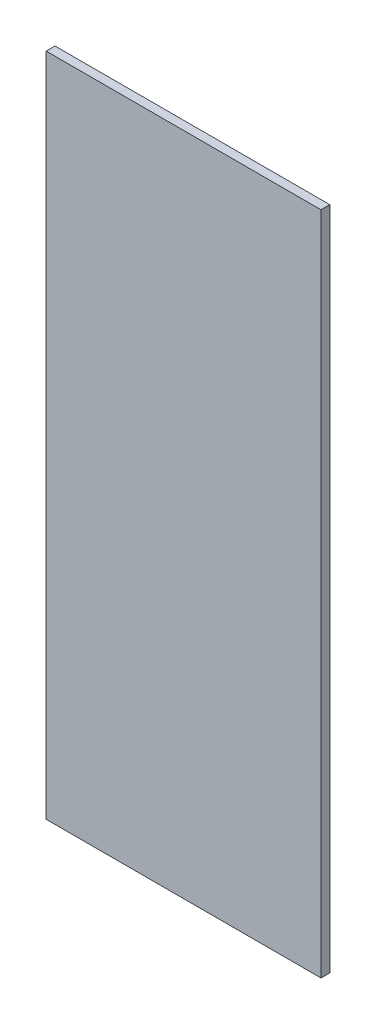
ISO-10303-21;
HEADER;
FILE_DESCRIPTION(('STEP AP214'),'2;1');
FILE_NAME('part.step','',(''),(''),'','','');
FILE_SCHEMA(('AUTOMOTIVE_DESIGN { 1 0 10303 214 1 1 1 1 }'));
ENDSEC;
DATA;
#1=APPLICATION_CONTEXT('core data for automotive mechanical design processes');
#2=APPLICATION_PROTOCOL_DEFINITION('international standard','automotive_design',2000,#1);
#3=PRODUCT_CONTEXT('',#1,'mechanical');
#4=PRODUCT('Part','Part','',(#3));
#5=PRODUCT_RELATED_PRODUCT_CATEGORY('part','',(#4));
#6=PRODUCT_DEFINITION_FORMATION('','',#4);
#7=PRODUCT_DEFINITION_CONTEXT('part definition',#1,'design');
#8=PRODUCT_DEFINITION('design','',#6,#7);
#9=PRODUCT_DEFINITION_SHAPE('','',#8);
#10=(LENGTH_UNIT() NAMED_UNIT(*) SI_UNIT(.MILLI.,.METRE.));
#11=(NAMED_UNIT(*) PLANE_ANGLE_UNIT() SI_UNIT($,.RADIAN.));
#12=(NAMED_UNIT(*) SI_UNIT($,.STERADIAN.) SOLID_ANGLE_UNIT());
#13=UNCERTAINTY_MEASURE_WITH_UNIT(LENGTH_MEASURE(1.E-05),#10,'distance_accuracy_value','');
#14=(GEOMETRIC_REPRESENTATION_CONTEXT(3) GLOBAL_UNCERTAINTY_ASSIGNED_CONTEXT((#13)) GLOBAL_UNIT_ASSIGNED_CONTEXT((#10,
#11,#12)) REPRESENTATION_CONTEXT('',''));
#15=CARTESIAN_POINT('',(0.,0.,0.));
#16=DIRECTION('',(0.,0.,1.));
#17=DIRECTION('',(1.,0.,0.));
#18=AXIS2_PLACEMENT_3D('',#15,#16,#17);
#19=CARTESIAN_POINT('',(6.575,19.35,-0.03048));
#20=DIRECTION('',(0.,-1.,0.));
#21=DIRECTION('',(0.,0.,-1.));
#22=AXIS2_PLACEMENT_3D('',#19,#20,#21);
#23=PLANE('',#22);
#24=DIRECTION('',(1.,0.,0.));
#25=VECTOR('',#24,1.);
#26=CARTESIAN_POINT('',(7.05,19.35,0.));
#27=LINE('',#26,#25);
#28=CARTESIAN_POINT('',(6.575,19.35,0.));
#29=VERTEX_POINT('',#28);
#30=CARTESIAN_POINT('',(7.525,19.35,0.));
#31=VERTEX_POINT('',#30);
#32=EDGE_CURVE('E74',#29,#31,#27,.T.);
#33=ORIENTED_EDGE('',*,*,#32,.T.);
#34=DIRECTION('',(0.,0.,-1.));
#35=VECTOR('',#34,1.);
#36=CARTESIAN_POINT('',(7.525,19.35,-0.01524));
#37=LINE('',#36,#35);
#38=CARTESIAN_POINT('',(7.525,19.35,-0.03048));
#39=VERTEX_POINT('',#38);
#40=EDGE_CURVE('E111',#31,#39,#37,.T.);
#41=ORIENTED_EDGE('',*,*,#40,.T.);
#42=DIRECTION('',(1.,0.,0.));
#43=VECTOR('',#42,1.);
#44=CARTESIAN_POINT('',(6.575,19.35,-0.03048));
#45=LINE('',#44,#43);
#46=CARTESIAN_POINT('',(6.575,19.35,-0.03048));
#47=VERTEX_POINT('',#46);
#48=EDGE_CURVE('E76',#47,#39,#45,.T.);
#49=ORIENTED_EDGE('',*,*,#48,.F.);
#50=DIRECTION('',(0.,0.,-1.));
#51=VECTOR('',#50,1.);
#52=CARTESIAN_POINT('',(6.575,19.35,-0.01524));
#53=LINE('',#52,#51);
#54=EDGE_CURVE('E11',#29,#47,#53,.T.);
#55=ORIENTED_EDGE('',*,*,#54,.F.);
#56=EDGE_LOOP('',(#33,#41,#49,#55));
#57=FACE_BOUND('',#56,.T.);
#58=ADVANCED_FACE('F17',(#57),#23,.F.);
#59=CARTESIAN_POINT('',(6.575,17.05,-0.03048));
#60=DIRECTION('',(1.,0.,0.));
#61=DIRECTION('',(0.,1.,0.));
#62=AXIS2_PLACEMENT_3D('',#59,#60,#61);
#63=PLANE('',#62);
#64=DIRECTION('',(0.,1.,0.));
#65=VECTOR('',#64,1.);
#66=CARTESIAN_POINT('',(6.575,18.2,0.));
#67=LINE('',#66,#65);
#68=CARTESIAN_POINT('',(6.575,17.05,0.));
#69=VERTEX_POINT('',#68);
#70=EDGE_CURVE('E80',#69,#29,#67,.T.);
#71=ORIENTED_EDGE('',*,*,#70,.T.);
#72=ORIENTED_EDGE('',*,*,#54,.T.);
#73=DIRECTION('',(0.,1.,0.));
#74=VECTOR('',#73,1.);
#75=CARTESIAN_POINT('',(6.575,17.05,-0.03048));
#76=LINE('',#75,#74);
#77=CARTESIAN_POINT('',(6.575,17.05,-0.03048));
#78=VERTEX_POINT('',#77);
#79=EDGE_CURVE('E108',#78,#47,#76,.T.);
#80=ORIENTED_EDGE('',*,*,#79,.F.);
#81=DIRECTION('',(0.,0.,-1.));
#82=VECTOR('',#81,1.);
#83=CARTESIAN_POINT('',(6.575,17.05,-0.01524));
#84=LINE('',#83,#82);
#85=EDGE_CURVE('E20',#69,#78,#84,.T.);
#86=ORIENTED_EDGE('',*,*,#85,.F.);
#87=EDGE_LOOP('',(#71,#72,#80,#86));
#88=FACE_BOUND('',#87,.T.);
#89=ADVANCED_FACE('F81',(#88),#63,.F.);
#90=CARTESIAN_POINT('',(7.525,17.05,-0.03048));
#91=DIRECTION('',(0.,1.,0.));
#92=DIRECTION('',(1.,0.,0.));
#93=AXIS2_PLACEMENT_3D('',#90,#91,#92);
#94=PLANE('',#93);
#95=DIRECTION('',(-1.,0.,0.));
#96=VECTOR('',#95,1.);
#97=CARTESIAN_POINT('',(7.05,17.05,0.));
#98=LINE('',#97,#96);
#99=CARTESIAN_POINT('',(7.525,17.05,0.));
#100=VERTEX_POINT('',#99);
#101=EDGE_CURVE('E85',#100,#69,#98,.T.);
#102=ORIENTED_EDGE('',*,*,#101,.T.);
#103=ORIENTED_EDGE('',*,*,#85,.T.);
#104=DIRECTION('',(-1.,0.,0.));
#105=VECTOR('',#104,1.);
#106=CARTESIAN_POINT('',(7.525,17.05,-0.03048));
#107=LINE('',#106,#105);
#108=CARTESIAN_POINT('',(7.525,17.05,-0.03048));
#109=VERTEX_POINT('',#108);
#110=EDGE_CURVE('E104',#109,#78,#107,.T.);
#111=ORIENTED_EDGE('',*,*,#110,.F.);
#112=DIRECTION('',(0.,0.,-1.));
#113=VECTOR('',#112,1.);
#114=CARTESIAN_POINT('',(7.525,17.05,-0.01524));
#115=LINE('',#114,#113);
#116=EDGE_CURVE('E47',#100,#109,#115,.T.);
#117=ORIENTED_EDGE('',*,*,#116,.F.);
#118=EDGE_LOOP('',(#102,#103,#111,#117));
#119=FACE_BOUND('',#118,.T.);
#120=ADVANCED_FACE('F139',(#119),#94,.F.);
#121=CARTESIAN_POINT('',(7.525,19.35,-0.03048));
#122=DIRECTION('',(-1.,0.,0.));
#123=DIRECTION('',(0.,0.,1.));
#124=AXIS2_PLACEMENT_3D('',#121,#122,#123);
#125=PLANE('',#124);
#126=DIRECTION('',(0.,-1.,0.));
#127=VECTOR('',#126,1.);
#128=CARTESIAN_POINT('',(7.525,18.2,0.));
#129=LINE('',#128,#127);
#130=EDGE_CURVE('E89',#31,#100,#129,.T.);
#131=ORIENTED_EDGE('',*,*,#130,.T.);
#132=ORIENTED_EDGE('',*,*,#116,.T.);
#133=DIRECTION('',(0.,-1.,0.));
#134=VECTOR('',#133,1.);
#135=CARTESIAN_POINT('',(7.525,19.35,-0.03048));
#136=LINE('',#135,#134);
#137=EDGE_CURVE('E100',#39,#109,#136,.T.);
#138=ORIENTED_EDGE('',*,*,#137,.F.);
#139=ORIENTED_EDGE('',*,*,#40,.F.);
#140=EDGE_LOOP('',(#131,#132,#138,#139));
#141=FACE_BOUND('',#140,.T.);
#142=ADVANCED_FACE('F133',(#141),#125,.F.);
#143=CARTESIAN_POINT('',(7.05,18.2,-0.03048));
#144=DIRECTION('',(0.,0.,1.));
#145=DIRECTION('',(1.,0.,0.));
#146=AXIS2_PLACEMENT_3D('',#143,#144,#145);
#147=PLANE('',#146);
#148=ORIENTED_EDGE('',*,*,#48,.T.);
#149=ORIENTED_EDGE('',*,*,#137,.T.);
#150=ORIENTED_EDGE('',*,*,#110,.T.);
#151=ORIENTED_EDGE('',*,*,#79,.T.);
#152=EDGE_LOOP('',(#148,#149,#150,#151));
#153=FACE_BOUND('',#152,.T.);
#154=ADVANCED_FACE('F124',(#153),#147,.F.);
#155=CARTESIAN_POINT('',(7.05,18.2,0.));
#156=DIRECTION('',(0.,0.,1.));
#157=DIRECTION('',(1.,0.,0.));
#158=AXIS2_PLACEMENT_3D('',#155,#156,#157);
#159=PLANE('',#158);
#160=ORIENTED_EDGE('',*,*,#32,.F.);
#161=ORIENTED_EDGE('',*,*,#70,.F.);
#162=ORIENTED_EDGE('',*,*,#101,.F.);
#163=ORIENTED_EDGE('',*,*,#130,.F.);
#164=EDGE_LOOP('',(#160,#161,#162,#163));
#165=FACE_BOUND('',#164,.T.);
#166=ADVANCED_FACE('F88',(#165),#159,.T.);
#167=CLOSED_SHELL('',(#58,#89,#120,#142,#154,#166));
#168=MANIFOLD_SOLID_BREP('B1',#167);
#169=ADVANCED_BREP_SHAPE_REPRESENTATION('',(#18,#168),#14);
#170=SHAPE_DEFINITION_REPRESENTATION(#9,#169);
ENDSEC;
END-ISO-10303-21;
